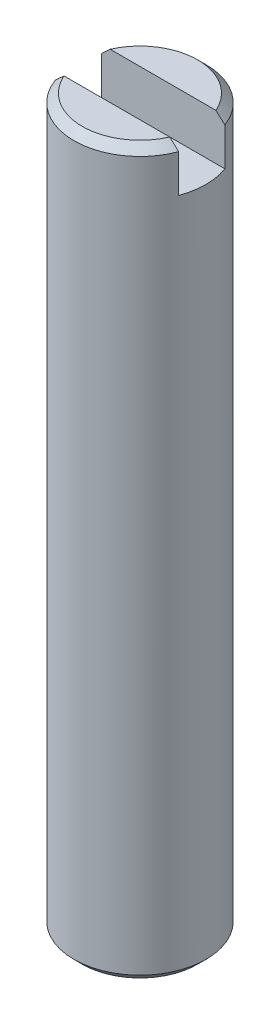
ISO-10303-21;
HEADER;
FILE_DESCRIPTION(('STEP AP214'),'2;1');
FILE_NAME('part.step','',(''),(''),'','','');
FILE_SCHEMA(('AUTOMOTIVE_DESIGN { 1 0 10303 214 1 1 1 1 }'));
ENDSEC;
DATA;
#1=APPLICATION_CONTEXT('core data for automotive mechanical design processes');
#2=APPLICATION_PROTOCOL_DEFINITION('international standard','automotive_design',2000,#1);
#3=PRODUCT_CONTEXT('',#1,'mechanical');
#4=PRODUCT('Part','Part','',(#3));
#5=PRODUCT_RELATED_PRODUCT_CATEGORY('part','',(#4));
#6=PRODUCT_DEFINITION_FORMATION('','',#4);
#7=PRODUCT_DEFINITION_CONTEXT('part definition',#1,'design');
#8=PRODUCT_DEFINITION('design','',#6,#7);
#9=PRODUCT_DEFINITION_SHAPE('','',#8);
#10=(LENGTH_UNIT() NAMED_UNIT(*) SI_UNIT(.MILLI.,.METRE.));
#11=(NAMED_UNIT(*) PLANE_ANGLE_UNIT() SI_UNIT($,.RADIAN.));
#12=(NAMED_UNIT(*) SI_UNIT($,.STERADIAN.) SOLID_ANGLE_UNIT());
#13=UNCERTAINTY_MEASURE_WITH_UNIT(LENGTH_MEASURE(1.E-05),#10,'distance_accuracy_value','');
#14=(GEOMETRIC_REPRESENTATION_CONTEXT(3) GLOBAL_UNCERTAINTY_ASSIGNED_CONTEXT((#13)) GLOBAL_UNIT_ASSIGNED_CONTEXT((#10,
#11,#12)) REPRESENTATION_CONTEXT('',''));
#15=CARTESIAN_POINT('',(0.,0.,0.));
#16=DIRECTION('',(0.,0.,1.));
#17=DIRECTION('',(1.,0.,0.));
#18=AXIS2_PLACEMENT_3D('',#15,#16,#17);
#19=CARTESIAN_POINT('',(0.,0.,0.));
#20=DIRECTION('',(0.,1.,0.));
#21=DIRECTION('',(0.,0.,1.));
#22=AXIS2_PLACEMENT_3D('',#19,#20,#21);
#23=PLANE('',#22);
#24=DIRECTION('',(1.,0.,0.));
#25=VECTOR('',#24,1.);
#26=CARTESIAN_POINT('',(1.87349939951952,0.,0.7));
#27=LINE('',#26,#25);
#28=CARTESIAN_POINT('',(-1.60390149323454,0.,0.7));
#29=VERTEX_POINT('',#28);
#30=CARTESIAN_POINT('',(1.60390149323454,0.,0.7));
#31=VERTEX_POINT('',#30);
#32=EDGE_CURVE('E105',#29,#31,#27,.T.);
#33=ORIENTED_EDGE('',*,*,#32,.F.);
#34=CARTESIAN_POINT('',(0.,0.,0.));
#35=DIRECTION('',(0.,1.,0.));
#36=DIRECTION('',(0.,0.,1.));
#37=AXIS2_PLACEMENT_3D('',#34,#35,#36);
#38=CIRCLE('',#37,1.75);
#39=EDGE_CURVE('E119',#29,#31,#38,.T.);
#40=ORIENTED_EDGE('',*,*,#39,.T.);
#41=EDGE_LOOP('',(#33,#40));
#42=FACE_BOUND('',#41,.T.);
#43=ADVANCED_FACE('F33',(#42),#23,.T.);
#44=CARTESIAN_POINT('',(0.,0.,0.));
#45=DIRECTION('',(0.,-1.,0.));
#46=DIRECTION('',(0.,0.,-1.));
#47=AXIS2_PLACEMENT_3D('',#44,#45,#46);
#48=CONICAL_SURFACE('',#47,1.75,0.785398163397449);
#49=CARTESIAN_POINT('',(-4.12689712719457,-2.4358427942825,0.7));
#50=CARTESIAN_POINT('',(-4.0115949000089,-2.3221697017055,0.7));
#51=CARTESIAN_POINT('',(-3.89623127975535,-2.20855878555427,0.7));
#52=CARTESIAN_POINT('',(-3.66523112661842,-1.98141609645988,0.7));
#53=CARTESIAN_POINT('',(-3.54959444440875,-1.86788447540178,0.7));
#54=CARTESIAN_POINT('',(-3.31629663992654,-1.63928757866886,0.7));
#55=CARTESIAN_POINT('',(-3.19863199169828,-1.52422589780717,0.7));
#56=CARTESIAN_POINT('',(-2.96308073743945,-1.2945321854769,0.7));
#57=CARTESIAN_POINT('',(-2.84519440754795,-1.17989987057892,0.7));
#58=CARTESIAN_POINT('',(-2.54926391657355,-0.89324265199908,0.7));
#59=CARTESIAN_POINT('',(-2.37094044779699,-0.721504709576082,0.7));
#60=CARTESIAN_POINT('',(-2.1017649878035,-0.465104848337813,0.7));
#61=CARTESIAN_POINT('',(-2.01161525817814,-0.379706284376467,0.7));
#62=CARTESIAN_POINT('',(-1.8306542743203,-0.209674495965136,0.7));
#63=CARTESIAN_POINT('',(-1.73984326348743,-0.125041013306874,0.7));
#64=CARTESIAN_POINT('',(-1.55835082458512,0.0420138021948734,0.7));
#65=CARTESIAN_POINT('',(-1.46768271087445,0.124449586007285,0.7));
#66=CARTESIAN_POINT('',(-1.28461516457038,0.287647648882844,0.7));
#67=CARTESIAN_POINT('',(-1.19221357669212,0.36840753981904,0.7));
#68=CARTESIAN_POINT('',(-1.05177134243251,0.486825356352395,0.7));
#69=CARTESIAN_POINT('',(-1.00478956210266,0.52573531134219,0.7));
#70=CARTESIAN_POINT('',(-0.909867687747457,0.602364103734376,0.7));
#71=CARTESIAN_POINT('',(-0.861927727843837,0.640083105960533,0.7));
#72=CARTESIAN_POINT('',(-0.764816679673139,0.713688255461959,0.7));
#73=CARTESIAN_POINT('',(-0.715648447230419,0.74957815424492,0.7));
#74=CARTESIAN_POINT('',(-0.615444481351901,0.818632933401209,0.7));
#75=CARTESIAN_POINT('',(-0.56441043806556,0.85180019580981,0.7));
#76=CARTESIAN_POINT('',(-0.500084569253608,0.889771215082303,0.7));
#77=CARTESIAN_POINT('',(-0.48805391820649,0.896714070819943,0.7));
#78=CARTESIAN_POINT('',(-0.463838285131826,0.910330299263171,0.7));
#79=CARTESIAN_POINT('',(-0.451653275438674,0.917003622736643,0.7));
#80=CARTESIAN_POINT('',(-0.41485386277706,0.936568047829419,0.7));
#81=CARTESIAN_POINT('',(-0.389994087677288,0.949004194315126,0.7));
#82=CARTESIAN_POINT('',(-0.339779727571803,0.972208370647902,0.7));
#83=CARTESIAN_POINT('',(-0.314431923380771,0.982990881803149,0.7));
#84=CARTESIAN_POINT('',(-0.262992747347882,1.00260519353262,0.7));
#85=CARTESIAN_POINT('',(-0.236901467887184,1.01143723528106,0.7));
#86=CARTESIAN_POINT('',(-0.170087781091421,1.03066405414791,0.7));
#87=CARTESIAN_POINT('',(-0.128871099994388,1.03944755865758,0.7));
#88=CARTESIAN_POINT('',(-0.0455958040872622,1.04972338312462,0.7));
#89=CARTESIAN_POINT('',(-0.00353961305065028,1.05123429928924,0.7));
#90=CARTESIAN_POINT('',(0.0801037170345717,1.04667366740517,0.7));
#91=CARTESIAN_POINT('',(0.121691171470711,1.04060756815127,0.7));
#92=CARTESIAN_POINT('',(0.20348980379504,1.0221232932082,0.7));
#93=CARTESIAN_POINT('',(0.243695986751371,1.00968422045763,0.7));
#94=CARTESIAN_POINT('',(0.332954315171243,0.976240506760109,0.7));
#95=CARTESIAN_POINT('',(0.381461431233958,0.953829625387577,0.7));
#96=CARTESIAN_POINT('',(0.47610664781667,0.904396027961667,0.7));
#97=CARTESIAN_POINT('',(0.522238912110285,0.877362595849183,0.7));
#98=CARTESIAN_POINT('',(0.613027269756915,0.820186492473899,0.7));
#99=CARTESIAN_POINT('',(0.657668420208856,0.790020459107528,0.7));
#100=CARTESIAN_POINT('',(0.745532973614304,0.727815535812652,0.7));
#101=CARTESIAN_POINT('',(0.788757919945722,0.695778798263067,0.7));
#102=CARTESIAN_POINT('',(0.879312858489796,0.626504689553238,0.7));
#103=CARTESIAN_POINT('',(0.926516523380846,0.589103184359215,0.7));
#104=CARTESIAN_POINT('',(1.02002257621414,0.513186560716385,0.7));
#105=CARTESIAN_POINT('',(1.06632486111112,0.474671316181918,0.7));
#106=CARTESIAN_POINT('',(1.20427851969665,0.357931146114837,0.7));
#107=CARTESIAN_POINT('',(1.29494044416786,0.278540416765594,0.7));
#108=CARTESIAN_POINT('',(1.47486750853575,0.117939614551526,0.7));
#109=CARTESIAN_POINT('',(1.56413032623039,0.036726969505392,0.7));
#110=CARTESIAN_POINT('',(1.74165485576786,-0.126743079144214,0.7));
#111=CARTESIAN_POINT('',(1.82991679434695,-0.209000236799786,0.7));
#112=CARTESIAN_POINT('',(2.00539577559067,-0.373844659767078,0.7));
#113=CARTESIAN_POINT('',(2.09261571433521,-0.456428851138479,0.7));
#114=CARTESIAN_POINT('',(2.26660173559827,-0.622083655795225,0.7));
#115=CARTESIAN_POINT('',(2.35336779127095,-0.70515429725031,0.7));
#116=CARTESIAN_POINT('',(2.61304770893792,-0.954757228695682,0.7));
#117=CARTESIAN_POINT('',(2.78547010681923,-1.12180048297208,0.7));
#118=CARTESIAN_POINT('',(3.05523718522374,-1.38432443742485,0.7));
#119=CARTESIAN_POINT('',(3.15283610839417,-1.47954472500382,0.7));
#120=CARTESIAN_POINT('',(3.34786183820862,-1.67019766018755,0.7));
#121=CARTESIAN_POINT('',(3.44528860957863,-1.76563034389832,0.7));
#122=CARTESIAN_POINT('',(3.64015503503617,-1.9568008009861,0.7));
#123=CARTESIAN_POINT('',(3.73759444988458,-2.05253881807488,0.7));
#124=CARTESIAN_POINT('',(3.93233657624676,-2.24411699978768,0.7));
#125=CARTESIAN_POINT('',(4.02963931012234,-2.33995714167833,0.7));
#126=CARTESIAN_POINT('',(4.12689712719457,-2.4358427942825,0.7));
#127=B_SPLINE_CURVE_WITH_KNOTS('',3,(#49,#50,#51,#52,#53,#54,#55,#56,#57,#58,#59,#60,#61,#62,
#63,#64,#65,#66,#67,#68,#69,#70,#71,#72,#73,#74,#75,#76,#77,#78,#79,#80,#81,#82,#83,#84,#85,#86,
#87,#88,#89,#90,#91,#92,#93,#94,#95,#96,#97,#98,#99,#100,#101,#102,#103,#104,#105,#106,#107,
#108,#109,#110,#111,#112,#113,#114,#115,#116,#117,#118,#119,#120,#121,#122,#123,#124,#125,#126),
.UNSPECIFIED.,.F.,.F.,(4,2,2,2,2,2,2,2,2,2,2,2,2,2,2,2,2,2,2,2,2,2,2,2,2,2,2,2,2,2,2,2,2,2,2,2,
2,2,4),(0.,0.485742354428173,0.971902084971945,1.46561938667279,1.95891415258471,
2.70162751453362,3.07415575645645,3.44655319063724,3.81416792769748,4.18227480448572,
4.36526948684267,4.54823873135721,4.73081620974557,4.91323220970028,4.95489999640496,
4.9965753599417,5.07992263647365,5.16249226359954,5.24505167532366,5.37092668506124,
5.49647965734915,5.62194239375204,5.74781918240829,5.90770625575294,6.06796913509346,
6.22952720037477,6.39090291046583,6.57155309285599,6.75222380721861,7.11370373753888,
7.47573087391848,7.83767429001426,8.19801522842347,8.55837724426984,9.27857767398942,
9.68764007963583,10.0967783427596,10.5065853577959,10.9163148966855),.UNSPECIFIED.);
#128=CARTESIAN_POINT('',(-1.87349939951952,-0.25,0.7));
#129=VERTEX_POINT('',#128);
#130=EDGE_CURVE('E11',#129,#29,#127,.T.);
#131=ORIENTED_EDGE('',*,*,#130,.F.);
#132=CARTESIAN_POINT('',(0.,-0.25,0.));
#133=DIRECTION('',(0.,1.,0.));
#134=DIRECTION('',(0.,0.,1.));
#135=AXIS2_PLACEMENT_3D('',#132,#133,#134);
#136=CIRCLE('',#135,2.);
#137=CARTESIAN_POINT('',(1.87349939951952,-0.25,0.7));
#138=VERTEX_POINT('',#137);
#139=EDGE_CURVE('E127',#138,#129,#136,.F.);
#140=ORIENTED_EDGE('',*,*,#139,.F.);
#141=EDGE_CURVE('E37',#31,#138,#127,.T.);
#142=ORIENTED_EDGE('',*,*,#141,.F.);
#143=ORIENTED_EDGE('',*,*,#39,.F.);
#144=EDGE_LOOP('',(#131,#140,#142,#143));
#145=FACE_BOUND('',#144,.T.);
#146=ADVANCED_FACE('F155',(#145),#48,.T.);
#147=CARTESIAN_POINT('',(0.,-22.,0.));
#148=DIRECTION('',(0.,1.,0.));
#149=DIRECTION('',(0.,0.,1.));
#150=AXIS2_PLACEMENT_3D('',#147,#148,#149);
#151=CYLINDRICAL_SURFACE('',#150,2.);
#152=DIRECTION('',(0.,1.,0.));
#153=VECTOR('',#152,1.);
#154=CARTESIAN_POINT('',(-1.87349939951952,-1.4,0.7));
#155=LINE('',#154,#153);
#156=CARTESIAN_POINT('',(-1.87349939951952,-1.4,0.7));
#157=VERTEX_POINT('',#156);
#158=EDGE_CURVE('E114',#157,#129,#155,.T.);
#159=ORIENTED_EDGE('',*,*,#158,.F.);
#160=CARTESIAN_POINT('',(0.,-1.4,0.));
#161=DIRECTION('',(0.,1.,0.));
#162=DIRECTION('',(0.,0.,1.));
#163=AXIS2_PLACEMENT_3D('',#160,#161,#162);
#164=CIRCLE('',#163,2.);
#165=CARTESIAN_POINT('',(-1.87349939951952,-1.4,-0.7));
#166=VERTEX_POINT('',#165);
#167=EDGE_CURVE('E96',#166,#157,#164,.T.);
#168=ORIENTED_EDGE('',*,*,#167,.F.);
#169=DIRECTION('',(0.,1.,0.));
#170=VECTOR('',#169,1.);
#171=CARTESIAN_POINT('',(-1.87349939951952,-1.4,-0.7));
#172=LINE('',#171,#170);
#173=CARTESIAN_POINT('',(-1.87349939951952,-0.25,-0.7));
#174=VERTEX_POINT('',#173);
#175=EDGE_CURVE('E93',#166,#174,#172,.T.);
#176=ORIENTED_EDGE('',*,*,#175,.T.);
#177=CARTESIAN_POINT('',(1.87349939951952,-0.25,-0.7));
#178=VERTEX_POINT('',#177);
#179=EDGE_CURVE('E112',#174,#178,#136,.F.);
#180=ORIENTED_EDGE('',*,*,#179,.T.);
#181=DIRECTION('',(0.,1.,0.));
#182=VECTOR('',#181,1.);
#183=CARTESIAN_POINT('',(1.87349939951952,-1.4,-0.7));
#184=LINE('',#183,#182);
#185=CARTESIAN_POINT('',(1.87349939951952,-1.4,-0.7));
#186=VERTEX_POINT('',#185);
#187=EDGE_CURVE('E90',#186,#178,#184,.T.);
#188=ORIENTED_EDGE('',*,*,#187,.F.);
#189=CARTESIAN_POINT('',(0.,-1.4,0.));
#190=DIRECTION('',(0.,1.,0.));
#191=DIRECTION('',(0.,0.,1.));
#192=AXIS2_PLACEMENT_3D('',#189,#190,#191);
#193=CIRCLE('',#192,2.);
#194=CARTESIAN_POINT('',(1.87349939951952,-1.4,0.7));
#195=VERTEX_POINT('',#194);
#196=EDGE_CURVE('E97',#195,#186,#193,.T.);
#197=ORIENTED_EDGE('',*,*,#196,.F.);
#198=DIRECTION('',(0.,1.,0.));
#199=VECTOR('',#198,1.);
#200=CARTESIAN_POINT('',(1.87349939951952,-1.4,0.7));
#201=LINE('',#200,#199);
#202=EDGE_CURVE('E123',#195,#138,#201,.T.);
#203=ORIENTED_EDGE('',*,*,#202,.T.);
#204=ORIENTED_EDGE('',*,*,#139,.T.);
#205=EDGE_LOOP('',(#159,#168,#176,#180,#188,#197,#203,#204));
#206=FACE_BOUND('',#205,.T.);
#207=CARTESIAN_POINT('',(0.,-21.75,0.));
#208=DIRECTION('',(0.,1.,0.));
#209=DIRECTION('',(0.,0.,1.));
#210=AXIS2_PLACEMENT_3D('',#207,#208,#209);
#211=CIRCLE('',#210,2.);
#212=CARTESIAN_POINT('',(0.,-21.75,2.));
#213=VERTEX_POINT('',#212);
#214=EDGE_CURVE('E124',#213,#213,#211,.T.);
#215=ORIENTED_EDGE('',*,*,#214,.T.);
#216=EDGE_LOOP('',(#215));
#217=FACE_BOUND('',#216,.T.);
#218=ADVANCED_FACE('F109',(#206,#217),#151,.T.);
#219=CARTESIAN_POINT('',(0.,-22.,0.));
#220=DIRECTION('',(0.,1.,0.));
#221=DIRECTION('',(0.,0.,1.));
#222=AXIS2_PLACEMENT_3D('',#219,#220,#221);
#223=PLANE('',#222);
#224=CARTESIAN_POINT('',(0.,-22.,0.));
#225=DIRECTION('',(0.,1.,0.));
#226=DIRECTION('',(0.,0.,1.));
#227=AXIS2_PLACEMENT_3D('',#224,#225,#226);
#228=CIRCLE('',#227,1.75);
#229=CARTESIAN_POINT('',(0.,-22.,1.75));
#230=VERTEX_POINT('',#229);
#231=EDGE_CURVE('E130',#230,#230,#228,.F.);
#232=ORIENTED_EDGE('',*,*,#231,.T.);
#233=EDGE_LOOP('',(#232));
#234=FACE_BOUND('',#233,.T.);
#235=ADVANCED_FACE('F147',(#234),#223,.F.);
#236=DIRECTION('',(-1.,0.,0.));
#237=VECTOR('',#236,1.);
#238=CARTESIAN_POINT('',(1.87349939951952,0.,-0.7));
#239=LINE('',#238,#237);
#240=CARTESIAN_POINT('',(1.60390149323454,0.,-0.7));
#241=VERTEX_POINT('',#240);
#242=CARTESIAN_POINT('',(-1.60390149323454,0.,-0.7));
#243=VERTEX_POINT('',#242);
#244=EDGE_CURVE('E52',#241,#243,#239,.T.);
#245=ORIENTED_EDGE('',*,*,#244,.F.);
#246=EDGE_CURVE('E122',#241,#243,#38,.T.);
#247=ORIENTED_EDGE('',*,*,#246,.T.);
#248=EDGE_LOOP('',(#245,#247));
#249=FACE_BOUND('',#248,.T.);
#250=ADVANCED_FACE('F150',(#249),#23,.T.);
#251=CARTESIAN_POINT('',(4.12689712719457,-2.4358427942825,-0.7));
#252=CARTESIAN_POINT('',(4.0115949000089,-2.3221697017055,-0.7));
#253=CARTESIAN_POINT('',(3.89623127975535,-2.20855878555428,-0.7));
#254=CARTESIAN_POINT('',(3.66523112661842,-1.98141609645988,-0.7));
#255=CARTESIAN_POINT('',(3.54959444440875,-1.86788447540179,-0.7));
#256=CARTESIAN_POINT('',(3.31629663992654,-1.63928757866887,-0.7));
#257=CARTESIAN_POINT('',(3.19863199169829,-1.52422589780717,-0.7));
#258=CARTESIAN_POINT('',(2.96308073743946,-1.29453218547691,-0.7));
#259=CARTESIAN_POINT('',(2.84519440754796,-1.17989987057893,-0.7));
#260=CARTESIAN_POINT('',(2.54926391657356,-0.893242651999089,-0.7));
#261=CARTESIAN_POINT('',(2.370940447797,-0.72150470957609,-0.7));
#262=CARTESIAN_POINT('',(2.10176498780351,-0.46510484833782,-0.7));
#263=CARTESIAN_POINT('',(2.01161525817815,-0.379706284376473,-0.7));
#264=CARTESIAN_POINT('',(1.83065427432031,-0.209674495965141,-0.7));
#265=CARTESIAN_POINT('',(1.73984326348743,-0.125041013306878,-0.7));
#266=CARTESIAN_POINT('',(1.55835082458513,0.0420138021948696,-0.7));
#267=CARTESIAN_POINT('',(1.46768271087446,0.124449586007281,-0.7));
#268=CARTESIAN_POINT('',(1.28461516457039,0.287647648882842,-0.7));
#269=CARTESIAN_POINT('',(1.19221357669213,0.368407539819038,-0.7));
#270=CARTESIAN_POINT('',(1.05177134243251,0.486825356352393,-0.7));
#271=CARTESIAN_POINT('',(1.00478956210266,0.525735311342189,-0.7));
#272=CARTESIAN_POINT('',(0.909867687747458,0.602364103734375,-0.7));
#273=CARTESIAN_POINT('',(0.861927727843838,0.640083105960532,-0.7));
#274=CARTESIAN_POINT('',(0.76481667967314,0.713688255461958,-0.7));
#275=CARTESIAN_POINT('',(0.71564844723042,0.74957815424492,-0.7));
#276=CARTESIAN_POINT('',(0.6154444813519,0.818632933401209,-0.7));
#277=CARTESIAN_POINT('',(0.564410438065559,0.85180019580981,-0.7));
#278=CARTESIAN_POINT('',(0.500084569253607,0.889771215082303,-0.7));
#279=CARTESIAN_POINT('',(0.488053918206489,0.896714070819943,-0.7));
#280=CARTESIAN_POINT('',(0.463838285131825,0.910330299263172,-0.7));
#281=CARTESIAN_POINT('',(0.451653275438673,0.917003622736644,-0.7));
#282=CARTESIAN_POINT('',(0.414853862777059,0.936568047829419,-0.7));
#283=CARTESIAN_POINT('',(0.389994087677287,0.949004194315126,-0.7));
#284=CARTESIAN_POINT('',(0.339779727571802,0.972208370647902,-0.7));
#285=CARTESIAN_POINT('',(0.31443192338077,0.982990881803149,-0.7));
#286=CARTESIAN_POINT('',(0.262992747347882,1.00260519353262,-0.7));
#287=CARTESIAN_POINT('',(0.236901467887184,1.01143723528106,-0.7));
#288=CARTESIAN_POINT('',(0.170087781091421,1.03066405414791,-0.7));
#289=CARTESIAN_POINT('',(0.128871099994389,1.03944755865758,-0.7));
#290=CARTESIAN_POINT('',(0.0455958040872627,1.04972338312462,-0.7));
#291=CARTESIAN_POINT('',(0.00353961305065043,1.05123429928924,-0.7));
#292=CARTESIAN_POINT('',(-0.0801037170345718,1.04667366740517,-0.7));
#293=CARTESIAN_POINT('',(-0.121691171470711,1.04060756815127,-0.7));
#294=CARTESIAN_POINT('',(-0.20348980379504,1.0221232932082,-0.7));
#295=CARTESIAN_POINT('',(-0.243695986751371,1.00968422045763,-0.7));
#296=CARTESIAN_POINT('',(-0.332954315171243,0.976240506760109,-0.7));
#297=CARTESIAN_POINT('',(-0.381461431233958,0.953829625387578,-0.7));
#298=CARTESIAN_POINT('',(-0.47610664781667,0.904396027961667,-0.7));
#299=CARTESIAN_POINT('',(-0.522238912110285,0.877362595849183,-0.7));
#300=CARTESIAN_POINT('',(-0.613027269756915,0.820186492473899,-0.7));
#301=CARTESIAN_POINT('',(-0.657668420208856,0.790020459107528,-0.7));
#302=CARTESIAN_POINT('',(-0.745532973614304,0.727815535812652,-0.7));
#303=CARTESIAN_POINT('',(-0.788757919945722,0.695778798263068,-0.7));
#304=CARTESIAN_POINT('',(-0.879312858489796,0.626504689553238,-0.7));
#305=CARTESIAN_POINT('',(-0.926516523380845,0.589103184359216,-0.7));
#306=CARTESIAN_POINT('',(-1.02002257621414,0.513186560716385,-0.7));
#307=CARTESIAN_POINT('',(-1.06632486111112,0.474671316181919,-0.7));
#308=CARTESIAN_POINT('',(-1.20427851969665,0.357931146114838,-0.7));
#309=CARTESIAN_POINT('',(-1.29494044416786,0.278540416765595,-0.7));
#310=CARTESIAN_POINT('',(-1.47486750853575,0.117939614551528,-0.7));
#311=CARTESIAN_POINT('',(-1.56413032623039,0.0367269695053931,-0.7));
#312=CARTESIAN_POINT('',(-1.74165485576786,-0.126743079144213,-0.7));
#313=CARTESIAN_POINT('',(-1.82991679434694,-0.209000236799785,-0.7));
#314=CARTESIAN_POINT('',(-2.00539577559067,-0.373844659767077,-0.7));
#315=CARTESIAN_POINT('',(-2.09261571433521,-0.456428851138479,-0.7));
#316=CARTESIAN_POINT('',(-2.26660173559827,-0.622083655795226,-0.7));
#317=CARTESIAN_POINT('',(-2.35336779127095,-0.705154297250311,-0.7));
#318=CARTESIAN_POINT('',(-2.61304770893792,-0.954757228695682,-0.7));
#319=CARTESIAN_POINT('',(-2.78547010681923,-1.12180048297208,-0.7));
#320=CARTESIAN_POINT('',(-3.05523718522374,-1.38432443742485,-0.7));
#321=CARTESIAN_POINT('',(-3.15283610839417,-1.47954472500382,-0.7));
#322=CARTESIAN_POINT('',(-3.34786183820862,-1.67019766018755,-0.7));
#323=CARTESIAN_POINT('',(-3.44528860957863,-1.76563034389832,-0.7));
#324=CARTESIAN_POINT('',(-3.64015503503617,-1.9568008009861,-0.7));
#325=CARTESIAN_POINT('',(-3.73759444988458,-2.05253881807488,-0.7));
#326=CARTESIAN_POINT('',(-3.93233657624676,-2.24411699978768,-0.7));
#327=CARTESIAN_POINT('',(-4.02963931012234,-2.33995714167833,-0.7));
#328=CARTESIAN_POINT('',(-4.12689712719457,-2.4358427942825,-0.7));
#329=B_SPLINE_CURVE_WITH_KNOTS('',3,(#251,#252,#253,#254,#255,#256,#257,#258,#259,#260,#261,
#262,#263,#264,#265,#266,#267,#268,#269,#270,#271,#272,#273,#274,#275,#276,#277,#278,#279,#280,
#281,#282,#283,#284,#285,#286,#287,#288,#289,#290,#291,#292,#293,#294,#295,#296,#297,#298,#299,
#300,#301,#302,#303,#304,#305,#306,#307,#308,#309,#310,#311,#312,#313,#314,#315,#316,#317,#318,
#319,#320,#321,#322,#323,#324,#325,#326,#327,#328),.UNSPECIFIED.,.F.,.F.,(4,2,2,2,2,2,2,2,2,2,2,
2,2,2,2,2,2,2,2,2,2,2,2,2,2,2,2,2,2,2,2,2,2,2,2,2,2,2,4),(0.,0.485742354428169,
0.971902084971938,1.46561938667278,1.95891415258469,2.70162751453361,3.07415575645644,
3.44655319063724,3.81416792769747,4.18227480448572,4.36526948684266,4.54823873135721,
4.73081620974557,4.91323220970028,4.95489999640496,4.9965753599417,5.07992263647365,
5.16249226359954,5.24505167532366,5.37092668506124,5.49647965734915,5.62194239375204,
5.74781918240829,5.90770625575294,6.06796913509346,6.22952720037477,6.39090291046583,
6.57155309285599,6.75222380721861,7.11370373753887,7.47573087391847,7.83767429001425,
8.19801522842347,8.55837724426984,9.27857767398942,9.68764007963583,10.0967783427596,
10.5065853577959,10.9163148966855),.UNSPECIFIED.);
#330=EDGE_CURVE('E137',#178,#241,#329,.T.);
#331=ORIENTED_EDGE('',*,*,#330,.F.);
#332=ORIENTED_EDGE('',*,*,#179,.F.);
#333=EDGE_CURVE('E132',#243,#174,#329,.T.);
#334=ORIENTED_EDGE('',*,*,#333,.F.);
#335=ORIENTED_EDGE('',*,*,#246,.F.);
#336=EDGE_LOOP('',(#331,#332,#334,#335));
#337=FACE_BOUND('',#336,.T.);
#338=ADVANCED_FACE('F138',(#337),#48,.T.);
#339=CARTESIAN_POINT('',(0.,-21.75,0.));
#340=DIRECTION('',(0.,1.,0.));
#341=DIRECTION('',(0.,0.,1.));
#342=AXIS2_PLACEMENT_3D('',#339,#340,#341);
#343=CONICAL_SURFACE('',#342,2.,0.785398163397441);
#344=ORIENTED_EDGE('',*,*,#231,.F.);
#345=EDGE_LOOP('',(#344));
#346=FACE_BOUND('',#345,.T.);
#347=ORIENTED_EDGE('',*,*,#214,.F.);
#348=EDGE_LOOP('',(#347));
#349=FACE_BOUND('',#348,.T.);
#350=ADVANCED_FACE('F35',(#346,#349),#343,.T.);
#351=CARTESIAN_POINT('',(1.87349939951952,-1.4,0.7));
#352=DIRECTION('',(0.,0.,1.));
#353=DIRECTION('',(1.,0.,0.));
#354=AXIS2_PLACEMENT_3D('',#351,#352,#353);
#355=PLANE('',#354);
#356=ORIENTED_EDGE('',*,*,#130,.T.);
#357=ORIENTED_EDGE('',*,*,#32,.T.);
#358=ORIENTED_EDGE('',*,*,#141,.T.);
#359=ORIENTED_EDGE('',*,*,#202,.F.);
#360=DIRECTION('',(1.,0.,0.));
#361=VECTOR('',#360,1.);
#362=CARTESIAN_POINT('',(1.87349939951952,-1.4,0.7));
#363=LINE('',#362,#361);
#364=EDGE_CURVE('E103',#157,#195,#363,.T.);
#365=ORIENTED_EDGE('',*,*,#364,.F.);
#366=ORIENTED_EDGE('',*,*,#158,.T.);
#367=EDGE_LOOP('',(#356,#357,#358,#359,#365,#366));
#368=FACE_BOUND('',#367,.T.);
#369=ADVANCED_FACE('F144',(#368),#355,.F.);
#370=CARTESIAN_POINT('',(1.87349939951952,-1.4,-0.7));
#371=DIRECTION('',(0.,0.,-1.));
#372=DIRECTION('',(-1.,0.,0.));
#373=AXIS2_PLACEMENT_3D('',#370,#371,#372);
#374=PLANE('',#373);
#375=ORIENTED_EDGE('',*,*,#330,.T.);
#376=ORIENTED_EDGE('',*,*,#244,.T.);
#377=ORIENTED_EDGE('',*,*,#333,.T.);
#378=ORIENTED_EDGE('',*,*,#175,.F.);
#379=DIRECTION('',(-1.,0.,0.));
#380=VECTOR('',#379,1.);
#381=CARTESIAN_POINT('',(1.87349939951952,-1.4,-0.7));
#382=LINE('',#381,#380);
#383=EDGE_CURVE('E86',#186,#166,#382,.T.);
#384=ORIENTED_EDGE('',*,*,#383,.F.);
#385=ORIENTED_EDGE('',*,*,#187,.T.);
#386=EDGE_LOOP('',(#375,#376,#377,#378,#384,#385));
#387=FACE_BOUND('',#386,.T.);
#388=ADVANCED_FACE('F88',(#387),#374,.F.);
#389=CARTESIAN_POINT('',(0.,-1.4,0.));
#390=DIRECTION('',(0.,1.,0.));
#391=DIRECTION('',(0.,0.,1.));
#392=AXIS2_PLACEMENT_3D('',#389,#390,#391);
#393=PLANE('',#392);
#394=ORIENTED_EDGE('',*,*,#196,.T.);
#395=ORIENTED_EDGE('',*,*,#383,.T.);
#396=ORIENTED_EDGE('',*,*,#167,.T.);
#397=ORIENTED_EDGE('',*,*,#364,.T.);
#398=EDGE_LOOP('',(#394,#395,#396,#397));
#399=FACE_BOUND('',#398,.T.);
#400=ADVANCED_FACE('F101',(#399),#393,.T.);
#401=CLOSED_SHELL('',(#43,#146,#218,#235,#250,#338,#350,#369,#388,#400));
#402=MANIFOLD_SOLID_BREP('B2',#401);
#403=ADVANCED_BREP_SHAPE_REPRESENTATION('',(#18,#402),#14);
#404=SHAPE_DEFINITION_REPRESENTATION(#9,#403);
ENDSEC;
END-ISO-10303-21;
